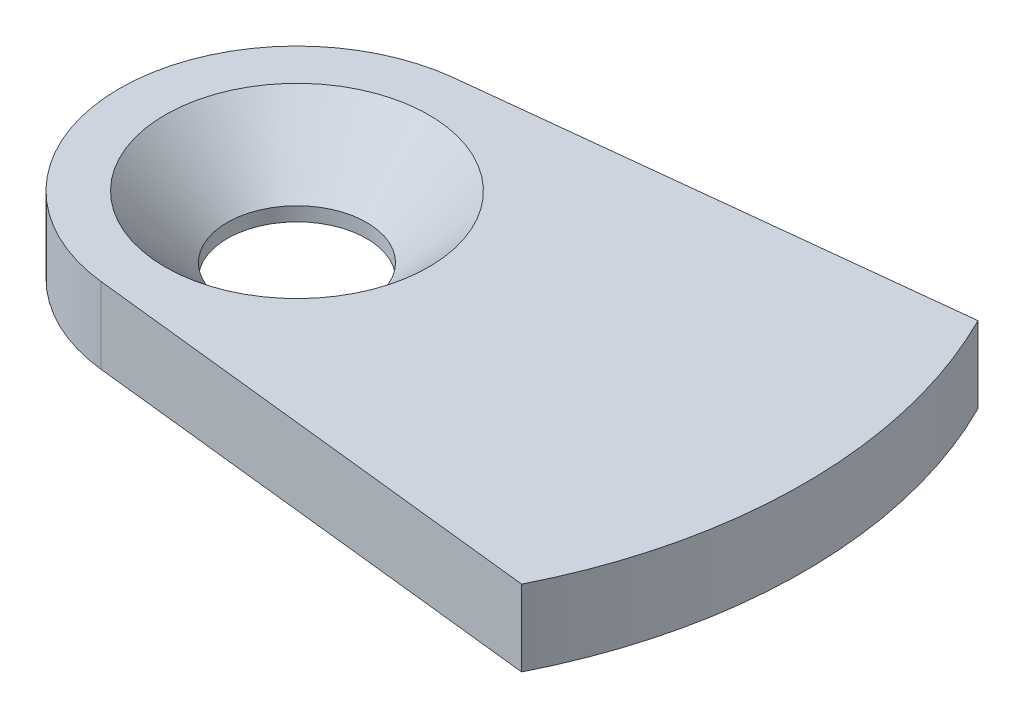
ISO-10303-21;
HEADER;
FILE_DESCRIPTION(('STEP AP214'),'2;1');
FILE_NAME('part.step','',(''),(''),'','','');
FILE_SCHEMA(('AUTOMOTIVE_DESIGN { 1 0 10303 214 1 1 1 1 }'));
ENDSEC;
DATA;
#1=APPLICATION_CONTEXT('core data for automotive mechanical design processes');
#2=APPLICATION_PROTOCOL_DEFINITION('international standard','automotive_design',2000,#1);
#3=PRODUCT_CONTEXT('',#1,'mechanical');
#4=PRODUCT('Part','Part','',(#3));
#5=PRODUCT_RELATED_PRODUCT_CATEGORY('part','',(#4));
#6=PRODUCT_DEFINITION_FORMATION('','',#4);
#7=PRODUCT_DEFINITION_CONTEXT('part definition',#1,'design');
#8=PRODUCT_DEFINITION('design','',#6,#7);
#9=PRODUCT_DEFINITION_SHAPE('','',#8);
#10=(LENGTH_UNIT() NAMED_UNIT(*) SI_UNIT(.MILLI.,.METRE.));
#11=(NAMED_UNIT(*) PLANE_ANGLE_UNIT() SI_UNIT($,.RADIAN.));
#12=(NAMED_UNIT(*) SI_UNIT($,.STERADIAN.) SOLID_ANGLE_UNIT());
#13=UNCERTAINTY_MEASURE_WITH_UNIT(LENGTH_MEASURE(1.E-05),#10,'distance_accuracy_value','');
#14=(GEOMETRIC_REPRESENTATION_CONTEXT(3) GLOBAL_UNCERTAINTY_ASSIGNED_CONTEXT((#13)) GLOBAL_UNIT_ASSIGNED_CONTEXT((#10,
#11,#12)) REPRESENTATION_CONTEXT('',''));
#15=CARTESIAN_POINT('',(0.,0.,0.));
#16=DIRECTION('',(0.,0.,1.));
#17=DIRECTION('',(1.,0.,0.));
#18=AXIS2_PLACEMENT_3D('',#15,#16,#17);
#19=CARTESIAN_POINT('',(0.,3.,0.));
#20=DIRECTION('',(0.,-1.,0.));
#21=DIRECTION('',(0.,0.,-1.));
#22=AXIS2_PLACEMENT_3D('',#19,#20,#21);
#23=CYLINDRICAL_SURFACE('',#22,7.);
#24=CARTESIAN_POINT('',(0.,0.,0.));
#25=DIRECTION('',(0.,1.,0.));
#26=DIRECTION('',(0.,0.,1.));
#27=AXIS2_PLACEMENT_3D('',#24,#25,#26);
#28=CIRCLE('',#27,7.);
#29=CARTESIAN_POINT('',(-0.762841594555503,0.,-6.95830961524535));
#30=VERTEX_POINT('',#29);
#31=CARTESIAN_POINT('',(-0.762841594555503,0.,6.95830961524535));
#32=VERTEX_POINT('',#31);
#33=EDGE_CURVE('E94',#30,#32,#28,.T.);
#34=ORIENTED_EDGE('',*,*,#33,.T.);
#35=DIRECTION('',(0.,-1.,0.));
#36=VECTOR('',#35,1.);
#37=CARTESIAN_POINT('',(-0.762841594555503,3.,6.95830961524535));
#38=LINE('',#37,#36);
#39=CARTESIAN_POINT('',(-0.762841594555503,3.,6.95830961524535));
#40=VERTEX_POINT('',#39);
#41=EDGE_CURVE('E11',#40,#32,#38,.T.);
#42=ORIENTED_EDGE('',*,*,#41,.F.);
#43=CARTESIAN_POINT('',(0.,3.,0.));
#44=DIRECTION('',(0.,1.,0.));
#45=DIRECTION('',(0.,0.,1.));
#46=AXIS2_PLACEMENT_3D('',#43,#44,#45);
#47=CIRCLE('',#46,7.);
#48=CARTESIAN_POINT('',(-0.762841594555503,3.,-6.95830961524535));
#49=VERTEX_POINT('',#48);
#50=EDGE_CURVE('E82',#49,#40,#47,.T.);
#51=ORIENTED_EDGE('',*,*,#50,.F.);
#52=DIRECTION('',(0.,-1.,0.));
#53=VECTOR('',#52,1.);
#54=CARTESIAN_POINT('',(-0.762841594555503,3.,-6.95830961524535));
#55=LINE('',#54,#53);
#56=EDGE_CURVE('E90',#49,#30,#55,.T.);
#57=ORIENTED_EDGE('',*,*,#56,.T.);
#58=EDGE_LOOP('',(#34,#42,#51,#57));
#59=FACE_BOUND('',#58,.T.);
#60=ADVANCED_FACE('F31',(#59),#23,.T.);
#61=CARTESIAN_POINT('',(-0.762841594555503,3.,6.95830961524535));
#62=DIRECTION('',(0.108977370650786,0.,-0.994044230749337));
#63=DIRECTION('',(-0.994044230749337,0.,-0.108977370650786));
#64=AXIS2_PLACEMENT_3D('',#61,#62,#63);
#65=PLANE('',#64);
#66=DIRECTION('',(0.994044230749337,0.,0.108977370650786));
#67=VECTOR('',#66,1.);
#68=CARTESIAN_POINT('',(-0.762841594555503,0.,6.95830961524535));
#69=LINE('',#68,#67);
#70=CARTESIAN_POINT('',(17.8605710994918,0.,9.));
#71=VERTEX_POINT('',#70);
#72=EDGE_CURVE('E86',#32,#71,#69,.T.);
#73=ORIENTED_EDGE('',*,*,#72,.T.);
#74=DIRECTION('',(0.,-1.,0.));
#75=VECTOR('',#74,1.);
#76=CARTESIAN_POINT('',(17.8605710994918,3.,9.));
#77=LINE('',#76,#75);
#78=CARTESIAN_POINT('',(17.8605710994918,3.,9.));
#79=VERTEX_POINT('',#78);
#80=EDGE_CURVE('E39',#79,#71,#77,.T.);
#81=ORIENTED_EDGE('',*,*,#80,.F.);
#82=DIRECTION('',(0.994044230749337,0.,0.108977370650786));
#83=VECTOR('',#82,1.);
#84=CARTESIAN_POINT('',(-0.762841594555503,3.,6.95830961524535));
#85=LINE('',#84,#83);
#86=EDGE_CURVE('E77',#40,#79,#85,.T.);
#87=ORIENTED_EDGE('',*,*,#86,.F.);
#88=ORIENTED_EDGE('',*,*,#41,.T.);
#89=EDGE_LOOP('',(#73,#81,#87,#88));
#90=FACE_BOUND('',#89,.T.);
#91=ADVANCED_FACE('F85',(#90),#65,.F.);
#92=CARTESIAN_POINT('',(0.,3.,0.));
#93=DIRECTION('',(0.,-1.,0.));
#94=DIRECTION('',(0.,0.,-1.));
#95=AXIS2_PLACEMENT_3D('',#92,#93,#94);
#96=CYLINDRICAL_SURFACE('',#95,20.);
#97=CARTESIAN_POINT('',(0.,0.,0.));
#98=DIRECTION('',(0.,1.,0.));
#99=DIRECTION('',(0.,0.,1.));
#100=AXIS2_PLACEMENT_3D('',#97,#98,#99);
#101=CIRCLE('',#100,20.);
#102=CARTESIAN_POINT('',(17.8605710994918,0.,-9.));
#103=VERTEX_POINT('',#102);
#104=EDGE_CURVE('E64',#71,#103,#101,.T.);
#105=ORIENTED_EDGE('',*,*,#104,.T.);
#106=DIRECTION('',(0.,-1.,0.));
#107=VECTOR('',#106,1.);
#108=CARTESIAN_POINT('',(17.8605710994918,3.,-9.));
#109=LINE('',#108,#107);
#110=CARTESIAN_POINT('',(17.8605710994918,3.,-9.));
#111=VERTEX_POINT('',#110);
#112=EDGE_CURVE('E87',#111,#103,#109,.T.);
#113=ORIENTED_EDGE('',*,*,#112,.F.);
#114=CARTESIAN_POINT('',(0.,3.,0.));
#115=DIRECTION('',(0.,1.,0.));
#116=DIRECTION('',(0.,0.,1.));
#117=AXIS2_PLACEMENT_3D('',#114,#115,#116);
#118=CIRCLE('',#117,20.);
#119=EDGE_CURVE('E80',#79,#111,#118,.T.);
#120=ORIENTED_EDGE('',*,*,#119,.F.);
#121=ORIENTED_EDGE('',*,*,#80,.T.);
#122=EDGE_LOOP('',(#105,#113,#120,#121));
#123=FACE_BOUND('',#122,.T.);
#124=ADVANCED_FACE('F88',(#123),#96,.T.);
#125=CARTESIAN_POINT('',(-0.762841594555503,3.,-6.95830961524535));
#126=DIRECTION('',(0.108977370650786,0.,0.994044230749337));
#127=DIRECTION('',(0.994044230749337,0.,-0.108977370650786));
#128=AXIS2_PLACEMENT_3D('',#125,#126,#127);
#129=PLANE('',#128);
#130=DIRECTION('',(-0.994044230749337,0.,0.108977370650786));
#131=VECTOR('',#130,1.);
#132=CARTESIAN_POINT('',(-0.762841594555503,0.,-6.95830961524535));
#133=LINE('',#132,#131);
#134=EDGE_CURVE('E70',#103,#30,#133,.T.);
#135=ORIENTED_EDGE('',*,*,#134,.T.);
#136=ORIENTED_EDGE('',*,*,#56,.F.);
#137=DIRECTION('',(-0.994044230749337,0.,0.108977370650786));
#138=VECTOR('',#137,1.);
#139=CARTESIAN_POINT('',(-0.762841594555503,3.,-6.95830961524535));
#140=LINE('',#139,#138);
#141=EDGE_CURVE('E47',#111,#49,#140,.T.);
#142=ORIENTED_EDGE('',*,*,#141,.F.);
#143=ORIENTED_EDGE('',*,*,#112,.T.);
#144=EDGE_LOOP('',(#135,#136,#142,#143));
#145=FACE_BOUND('',#144,.T.);
#146=ADVANCED_FACE('F102',(#145),#129,.F.);
#147=CARTESIAN_POINT('',(0.,3.,0.));
#148=DIRECTION('',(0.,1.,0.));
#149=DIRECTION('',(0.,0.,1.));
#150=AXIS2_PLACEMENT_3D('',#147,#148,#149);
#151=PLANE('',#150);
#152=CARTESIAN_POINT('',(0.,3.,0.));
#153=DIRECTION('',(0.,1.,0.));
#154=DIRECTION('',(0.,0.,1.));
#155=AXIS2_PLACEMENT_3D('',#152,#153,#154);
#156=CIRCLE('',#155,5.2);
#157=CARTESIAN_POINT('',(0.,3.,5.2));
#158=VERTEX_POINT('',#157);
#159=EDGE_CURVE('E113',#158,#158,#156,.T.);
#160=ORIENTED_EDGE('',*,*,#159,.F.);
#161=EDGE_LOOP('',(#160));
#162=FACE_BOUND('',#161,.T.);
#163=ORIENTED_EDGE('',*,*,#50,.T.);
#164=ORIENTED_EDGE('',*,*,#86,.T.);
#165=ORIENTED_EDGE('',*,*,#119,.T.);
#166=ORIENTED_EDGE('',*,*,#141,.T.);
#167=EDGE_LOOP('',(#163,#164,#165,#166));
#168=FACE_BOUND('',#167,.T.);
#169=ADVANCED_FACE('F78',(#162,#168),#151,.T.);
#170=CARTESIAN_POINT('',(0.,0.,0.));
#171=DIRECTION('',(0.,1.,0.));
#172=DIRECTION('',(0.,0.,1.));
#173=AXIS2_PLACEMENT_3D('',#170,#171,#172);
#174=PLANE('',#173);
#175=CARTESIAN_POINT('',(0.,0.,0.));
#176=DIRECTION('',(0.,1.,0.));
#177=DIRECTION('',(0.,0.,1.));
#178=AXIS2_PLACEMENT_3D('',#175,#176,#177);
#179=CIRCLE('',#178,2.75);
#180=CARTESIAN_POINT('',(0.,0.,2.75));
#181=VERTEX_POINT('',#180);
#182=EDGE_CURVE('E97',#181,#181,#179,.T.);
#183=ORIENTED_EDGE('',*,*,#182,.T.);
#184=EDGE_LOOP('',(#183));
#185=FACE_BOUND('',#184,.T.);
#186=ORIENTED_EDGE('',*,*,#33,.F.);
#187=ORIENTED_EDGE('',*,*,#134,.F.);
#188=ORIENTED_EDGE('',*,*,#104,.F.);
#189=ORIENTED_EDGE('',*,*,#72,.F.);
#190=EDGE_LOOP('',(#186,#187,#188,#189));
#191=FACE_BOUND('',#190,.T.);
#192=ADVANCED_FACE('F105',(#185,#191),#174,.F.);
#193=CARTESIAN_POINT('',(0.,3.,0.));
#194=DIRECTION('',(0.,1.,0.));
#195=DIRECTION('',(0.,0.,1.));
#196=AXIS2_PLACEMENT_3D('',#193,#194,#195);
#197=CYLINDRICAL_SURFACE('',#196,2.75);
#198=ORIENTED_EDGE('',*,*,#182,.F.);
#199=EDGE_LOOP('',(#198));
#200=FACE_BOUND('',#199,.T.);
#201=CARTESIAN_POINT('',(0.,0.549999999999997,0.));
#202=DIRECTION('',(0.,1.,0.));
#203=DIRECTION('',(0.,0.,1.));
#204=AXIS2_PLACEMENT_3D('',#201,#202,#203);
#205=CIRCLE('',#204,2.75);
#206=CARTESIAN_POINT('',(0.,0.549999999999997,2.75));
#207=VERTEX_POINT('',#206);
#208=EDGE_CURVE('E110',#207,#207,#205,.T.);
#209=ORIENTED_EDGE('',*,*,#208,.T.);
#210=EDGE_LOOP('',(#209));
#211=FACE_BOUND('',#210,.T.);
#212=ADVANCED_FACE('F125',(#200,#211),#197,.F.);
#213=CARTESIAN_POINT('',(0.,3.,0.));
#214=DIRECTION('',(0.,1.,0.));
#215=DIRECTION('',(0.,0.,1.));
#216=AXIS2_PLACEMENT_3D('',#213,#214,#215);
#217=CONICAL_SURFACE('',#216,5.2,0.785398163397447);
#218=ORIENTED_EDGE('',*,*,#208,.F.);
#219=EDGE_LOOP('',(#218));
#220=FACE_BOUND('',#219,.T.);
#221=ORIENTED_EDGE('',*,*,#159,.T.);
#222=EDGE_LOOP('',(#221));
#223=FACE_BOUND('',#222,.T.);
#224=ADVANCED_FACE('F117',(#220,#223),#217,.F.);
#225=CLOSED_SHELL('',(#60,#91,#124,#146,#169,#192,#212,#224));
#226=MANIFOLD_SOLID_BREP('B2',#225);
#227=ADVANCED_BREP_SHAPE_REPRESENTATION('',(#18,#226),#14);
#228=SHAPE_DEFINITION_REPRESENTATION(#9,#227);
ENDSEC;
END-ISO-10303-21;
